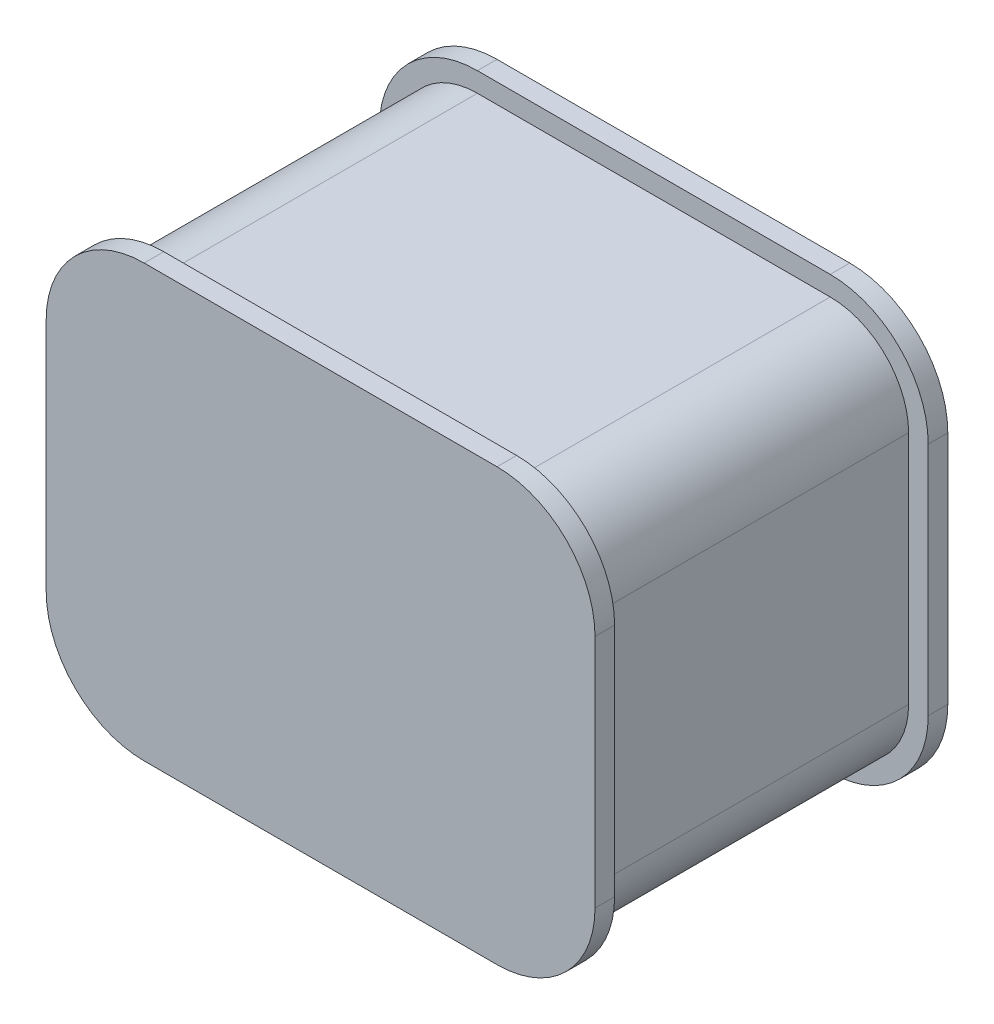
ISO-10303-21;
HEADER;
FILE_DESCRIPTION(('STEP AP214'),'2;1');
FILE_NAME('part.step','',(''),(''),'','','');
FILE_SCHEMA(('AUTOMOTIVE_DESIGN { 1 0 10303 214 1 1 1 1 }'));
ENDSEC;
DATA;
#1=APPLICATION_CONTEXT('core data for automotive mechanical design processes');
#2=APPLICATION_PROTOCOL_DEFINITION('international standard','automotive_design',2000,#1);
#3=PRODUCT_CONTEXT('',#1,'mechanical');
#4=PRODUCT('Part','Part','',(#3));
#5=PRODUCT_RELATED_PRODUCT_CATEGORY('part','',(#4));
#6=PRODUCT_DEFINITION_FORMATION('','',#4);
#7=PRODUCT_DEFINITION_CONTEXT('part definition',#1,'design');
#8=PRODUCT_DEFINITION('design','',#6,#7);
#9=PRODUCT_DEFINITION_SHAPE('','',#8);
#10=(LENGTH_UNIT() NAMED_UNIT(*) SI_UNIT(.MILLI.,.METRE.));
#11=(NAMED_UNIT(*) PLANE_ANGLE_UNIT() SI_UNIT($,.RADIAN.));
#12=(NAMED_UNIT(*) SI_UNIT($,.STERADIAN.) SOLID_ANGLE_UNIT());
#13=UNCERTAINTY_MEASURE_WITH_UNIT(LENGTH_MEASURE(1.E-05),#10,'distance_accuracy_value','');
#14=(GEOMETRIC_REPRESENTATION_CONTEXT(3) GLOBAL_UNCERTAINTY_ASSIGNED_CONTEXT((#13)) GLOBAL_UNIT_ASSIGNED_CONTEXT((#10,
#11,#12)) REPRESENTATION_CONTEXT('',''));
#15=CARTESIAN_POINT('',(0.,0.,0.));
#16=DIRECTION('',(0.,0.,1.));
#17=DIRECTION('',(1.,0.,0.));
#18=AXIS2_PLACEMENT_3D('',#15,#16,#17);
#19=CARTESIAN_POINT('',(-45.,30.,40.));
#20=DIRECTION('',(0.,0.,-1.));
#21=DIRECTION('',(-1.,0.,0.));
#22=AXIS2_PLACEMENT_3D('',#19,#20,#21);
#23=CYLINDRICAL_SURFACE('',#22,20.);
#24=DIRECTION('',(0.,0.,-1.));
#25=VECTOR('',#24,1.);
#26=CARTESIAN_POINT('',(-45.,50.,40.));
#27=LINE('',#26,#25);
#28=CARTESIAN_POINT('',(-45.,50.,40.));
#29=VERTEX_POINT('',#28);
#30=CARTESIAN_POINT('',(-45.,50.,-40.));
#31=VERTEX_POINT('',#30);
#32=EDGE_CURVE('E369',#29,#31,#27,.T.);
#33=ORIENTED_EDGE('',*,*,#32,.T.);
#34=CARTESIAN_POINT('',(-45.,30.,-40.));
#35=DIRECTION('',(0.,0.,1.));
#36=DIRECTION('',(1.,0.,0.));
#37=AXIS2_PLACEMENT_3D('',#34,#35,#36);
#38=CIRCLE('',#37,20.);
#39=CARTESIAN_POINT('',(-65.,30.,-40.));
#40=VERTEX_POINT('',#39);
#41=EDGE_CURVE('E200',#31,#40,#38,.T.);
#42=ORIENTED_EDGE('',*,*,#41,.T.);
#43=DIRECTION('',(0.,0.,-1.));
#44=VECTOR('',#43,1.);
#45=CARTESIAN_POINT('',(-65.,30.,40.));
#46=LINE('',#45,#44);
#47=CARTESIAN_POINT('',(-65.,30.,40.));
#48=VERTEX_POINT('',#47);
#49=EDGE_CURVE('E11',#48,#40,#46,.T.);
#50=ORIENTED_EDGE('',*,*,#49,.F.);
#51=CARTESIAN_POINT('',(-45.,30.,40.));
#52=DIRECTION('',(0.,0.,1.));
#53=DIRECTION('',(1.,0.,0.));
#54=AXIS2_PLACEMENT_3D('',#51,#52,#53);
#55=CIRCLE('',#54,20.);
#56=EDGE_CURVE('E345',#29,#48,#55,.T.);
#57=ORIENTED_EDGE('',*,*,#56,.F.);
#58=EDGE_LOOP('',(#33,#42,#50,#57));
#59=FACE_BOUND('',#58,.T.);
#60=ADVANCED_FACE('F29',(#59),#23,.T.);
#61=CARTESIAN_POINT('',(-65.,30.,40.));
#62=DIRECTION('',(1.,0.,0.));
#63=DIRECTION('',(0.,1.,0.));
#64=AXIS2_PLACEMENT_3D('',#61,#62,#63);
#65=PLANE('',#64);
#66=ORIENTED_EDGE('',*,*,#49,.T.);
#67=DIRECTION('',(0.,-1.,0.));
#68=VECTOR('',#67,1.);
#69=CARTESIAN_POINT('',(-65.,30.,-40.));
#70=LINE('',#69,#68);
#71=CARTESIAN_POINT('',(-65.,-30.,-40.));
#72=VERTEX_POINT('',#71);
#73=EDGE_CURVE('E268',#40,#72,#70,.T.);
#74=ORIENTED_EDGE('',*,*,#73,.T.);
#75=DIRECTION('',(0.,0.,-1.));
#76=VECTOR('',#75,1.);
#77=CARTESIAN_POINT('',(-65.,-30.,40.));
#78=LINE('',#77,#76);
#79=CARTESIAN_POINT('',(-65.,-30.,40.));
#80=VERTEX_POINT('',#79);
#81=EDGE_CURVE('E36',#80,#72,#78,.T.);
#82=ORIENTED_EDGE('',*,*,#81,.F.);
#83=DIRECTION('',(0.,-1.,0.));
#84=VECTOR('',#83,1.);
#85=CARTESIAN_POINT('',(-65.,30.,40.));
#86=LINE('',#85,#84);
#87=EDGE_CURVE('E348',#48,#80,#86,.T.);
#88=ORIENTED_EDGE('',*,*,#87,.F.);
#89=EDGE_LOOP('',(#66,#74,#82,#88));
#90=FACE_BOUND('',#89,.T.);
#91=ADVANCED_FACE('F388',(#90),#65,.F.);
#92=CARTESIAN_POINT('',(-45.,-30.,40.));
#93=DIRECTION('',(0.,0.,-1.));
#94=DIRECTION('',(-1.,0.,0.));
#95=AXIS2_PLACEMENT_3D('',#92,#93,#94);
#96=CYLINDRICAL_SURFACE('',#95,20.);
#97=ORIENTED_EDGE('',*,*,#81,.T.);
#98=CARTESIAN_POINT('',(-45.,-30.,-40.));
#99=DIRECTION('',(0.,0.,1.));
#100=DIRECTION('',(1.,0.,0.));
#101=AXIS2_PLACEMENT_3D('',#98,#99,#100);
#102=CIRCLE('',#101,20.);
#103=CARTESIAN_POINT('',(-45.,-50.,-40.));
#104=VERTEX_POINT('',#103);
#105=EDGE_CURVE('E271',#72,#104,#102,.T.);
#106=ORIENTED_EDGE('',*,*,#105,.T.);
#107=DIRECTION('',(0.,0.,-1.));
#108=VECTOR('',#107,1.);
#109=CARTESIAN_POINT('',(-45.,-50.,40.));
#110=LINE('',#109,#108);
#111=CARTESIAN_POINT('',(-45.,-50.,40.));
#112=VERTEX_POINT('',#111);
#113=EDGE_CURVE('E377',#112,#104,#110,.T.);
#114=ORIENTED_EDGE('',*,*,#113,.F.);
#115=CARTESIAN_POINT('',(-45.,-30.,40.));
#116=DIRECTION('',(0.,0.,1.));
#117=DIRECTION('',(1.,0.,0.));
#118=AXIS2_PLACEMENT_3D('',#115,#116,#117);
#119=CIRCLE('',#118,20.);
#120=EDGE_CURVE('E351',#80,#112,#119,.T.);
#121=ORIENTED_EDGE('',*,*,#120,.F.);
#122=EDGE_LOOP('',(#97,#106,#114,#121));
#123=FACE_BOUND('',#122,.T.);
#124=ADVANCED_FACE('F381',(#123),#96,.T.);
#125=CARTESIAN_POINT('',(-45.,-50.,40.));
#126=DIRECTION('',(0.,1.,0.));
#127=DIRECTION('',(-1.,0.,0.));
#128=AXIS2_PLACEMENT_3D('',#125,#126,#127);
#129=PLANE('',#128);
#130=ORIENTED_EDGE('',*,*,#113,.T.);
#131=DIRECTION('',(1.,0.,0.));
#132=VECTOR('',#131,1.);
#133=CARTESIAN_POINT('',(-45.,-50.,-40.));
#134=LINE('',#133,#132);
#135=CARTESIAN_POINT('',(45.,-50.,-40.));
#136=VERTEX_POINT('',#135);
#137=EDGE_CURVE('E274',#104,#136,#134,.T.);
#138=ORIENTED_EDGE('',*,*,#137,.T.);
#139=DIRECTION('',(0.,0.,-1.));
#140=VECTOR('',#139,1.);
#141=CARTESIAN_POINT('',(45.,-50.,40.));
#142=LINE('',#141,#140);
#143=CARTESIAN_POINT('',(45.,-50.,40.));
#144=VERTEX_POINT('',#143);
#145=EDGE_CURVE('E375',#144,#136,#142,.T.);
#146=ORIENTED_EDGE('',*,*,#145,.F.);
#147=DIRECTION('',(1.,0.,0.));
#148=VECTOR('',#147,1.);
#149=CARTESIAN_POINT('',(-45.,-50.,40.));
#150=LINE('',#149,#148);
#151=EDGE_CURVE('E354',#112,#144,#150,.T.);
#152=ORIENTED_EDGE('',*,*,#151,.F.);
#153=EDGE_LOOP('',(#130,#138,#146,#152));
#154=FACE_BOUND('',#153,.T.);
#155=ADVANCED_FACE('F405',(#154),#129,.F.);
#156=CARTESIAN_POINT('',(45.,-30.,40.));
#157=DIRECTION('',(0.,0.,-1.));
#158=DIRECTION('',(-1.,0.,0.));
#159=AXIS2_PLACEMENT_3D('',#156,#157,#158);
#160=CYLINDRICAL_SURFACE('',#159,20.);
#161=ORIENTED_EDGE('',*,*,#145,.T.);
#162=CARTESIAN_POINT('',(45.,-30.,-40.));
#163=DIRECTION('',(0.,0.,1.));
#164=DIRECTION('',(1.,0.,0.));
#165=AXIS2_PLACEMENT_3D('',#162,#163,#164);
#166=CIRCLE('',#165,20.);
#167=CARTESIAN_POINT('',(65.,-30.,-40.));
#168=VERTEX_POINT('',#167);
#169=EDGE_CURVE('E277',#136,#168,#166,.T.);
#170=ORIENTED_EDGE('',*,*,#169,.T.);
#171=DIRECTION('',(0.,0.,-1.));
#172=VECTOR('',#171,1.);
#173=CARTESIAN_POINT('',(65.,-30.,40.));
#174=LINE('',#173,#172);
#175=CARTESIAN_POINT('',(65.,-30.,40.));
#176=VERTEX_POINT('',#175);
#177=EDGE_CURVE('E373',#176,#168,#174,.T.);
#178=ORIENTED_EDGE('',*,*,#177,.F.);
#179=CARTESIAN_POINT('',(45.,-30.,40.));
#180=DIRECTION('',(0.,0.,1.));
#181=DIRECTION('',(1.,0.,0.));
#182=AXIS2_PLACEMENT_3D('',#179,#180,#181);
#183=CIRCLE('',#182,20.);
#184=EDGE_CURVE('E357',#144,#176,#183,.T.);
#185=ORIENTED_EDGE('',*,*,#184,.F.);
#186=EDGE_LOOP('',(#161,#170,#178,#185));
#187=FACE_BOUND('',#186,.T.);
#188=ADVANCED_FACE('F402',(#187),#160,.T.);
#189=CARTESIAN_POINT('',(65.,30.,40.));
#190=DIRECTION('',(-1.,0.,0.));
#191=DIRECTION('',(0.,0.,1.));
#192=AXIS2_PLACEMENT_3D('',#189,#190,#191);
#193=PLANE('',#192);
#194=ORIENTED_EDGE('',*,*,#177,.T.);
#195=DIRECTION('',(0.,1.,0.));
#196=VECTOR('',#195,1.);
#197=CARTESIAN_POINT('',(65.,30.,-40.));
#198=LINE('',#197,#196);
#199=CARTESIAN_POINT('',(65.,30.,-40.));
#200=VERTEX_POINT('',#199);
#201=EDGE_CURVE('E280',#168,#200,#198,.T.);
#202=ORIENTED_EDGE('',*,*,#201,.T.);
#203=DIRECTION('',(0.,0.,-1.));
#204=VECTOR('',#203,1.);
#205=CARTESIAN_POINT('',(65.,30.,40.));
#206=LINE('',#205,#204);
#207=CARTESIAN_POINT('',(65.,30.,40.));
#208=VERTEX_POINT('',#207);
#209=EDGE_CURVE('E51',#208,#200,#206,.T.);
#210=ORIENTED_EDGE('',*,*,#209,.F.);
#211=DIRECTION('',(0.,1.,0.));
#212=VECTOR('',#211,1.);
#213=CARTESIAN_POINT('',(65.,30.,40.));
#214=LINE('',#213,#212);
#215=EDGE_CURVE('E360',#176,#208,#214,.T.);
#216=ORIENTED_EDGE('',*,*,#215,.F.);
#217=EDGE_LOOP('',(#194,#202,#210,#216));
#218=FACE_BOUND('',#217,.T.);
#219=ADVANCED_FACE('F400',(#218),#193,.F.);
#220=CARTESIAN_POINT('',(45.,30.,40.));
#221=DIRECTION('',(0.,0.,-1.));
#222=DIRECTION('',(-1.,0.,0.));
#223=AXIS2_PLACEMENT_3D('',#220,#221,#222);
#224=CYLINDRICAL_SURFACE('',#223,20.);
#225=ORIENTED_EDGE('',*,*,#209,.T.);
#226=CARTESIAN_POINT('',(45.,30.,-40.));
#227=DIRECTION('',(0.,0.,1.));
#228=DIRECTION('',(-1.,0.,0.));
#229=AXIS2_PLACEMENT_3D('',#226,#227,#228);
#230=CIRCLE('',#229,20.);
#231=CARTESIAN_POINT('',(45.,50.,-40.));
#232=VERTEX_POINT('',#231);
#233=EDGE_CURVE('E282',#200,#232,#230,.T.);
#234=ORIENTED_EDGE('',*,*,#233,.T.);
#235=DIRECTION('',(0.,0.,-1.));
#236=VECTOR('',#235,1.);
#237=CARTESIAN_POINT('',(45.,50.,40.));
#238=LINE('',#237,#236);
#239=CARTESIAN_POINT('',(45.,50.,40.));
#240=VERTEX_POINT('',#239);
#241=EDGE_CURVE('E43',#240,#232,#238,.T.);
#242=ORIENTED_EDGE('',*,*,#241,.F.);
#243=CARTESIAN_POINT('',(45.,30.,40.));
#244=DIRECTION('',(0.,0.,1.));
#245=DIRECTION('',(-1.,0.,0.));
#246=AXIS2_PLACEMENT_3D('',#243,#244,#245);
#247=CIRCLE('',#246,20.);
#248=EDGE_CURVE('E363',#208,#240,#247,.T.);
#249=ORIENTED_EDGE('',*,*,#248,.F.);
#250=EDGE_LOOP('',(#225,#234,#242,#249));
#251=FACE_BOUND('',#250,.T.);
#252=ADVANCED_FACE('F398',(#251),#224,.T.);
#253=CARTESIAN_POINT('',(-45.,50.,40.));
#254=DIRECTION('',(0.,-1.,0.));
#255=DIRECTION('',(1.,0.,0.));
#256=AXIS2_PLACEMENT_3D('',#253,#254,#255);
#257=PLANE('',#256);
#258=ORIENTED_EDGE('',*,*,#241,.T.);
#259=DIRECTION('',(-1.,0.,0.));
#260=VECTOR('',#259,1.);
#261=CARTESIAN_POINT('',(-45.,50.,-40.));
#262=LINE('',#261,#260);
#263=EDGE_CURVE('E284',#232,#31,#262,.T.);
#264=ORIENTED_EDGE('',*,*,#263,.T.);
#265=ORIENTED_EDGE('',*,*,#32,.F.);
#266=DIRECTION('',(-1.,0.,0.));
#267=VECTOR('',#266,1.);
#268=CARTESIAN_POINT('',(-45.,50.,40.));
#269=LINE('',#268,#267);
#270=EDGE_CURVE('E366',#240,#29,#269,.T.);
#271=ORIENTED_EDGE('',*,*,#270,.F.);
#272=EDGE_LOOP('',(#258,#264,#265,#271));
#273=FACE_BOUND('',#272,.T.);
#274=ADVANCED_FACE('F395',(#273),#257,.F.);
#275=CARTESIAN_POINT('',(-45.,30.,40.));
#276=DIRECTION('',(0.,0.,1.));
#277=DIRECTION('',(1.,0.,0.));
#278=AXIS2_PLACEMENT_3D('',#275,#276,#277);
#279=PLANE('',#278);
#280=CARTESIAN_POINT('',(-45.,30.,40.));
#281=DIRECTION('',(0.,0.,1.));
#282=DIRECTION('',(1.,0.,0.));
#283=AXIS2_PLACEMENT_3D('',#280,#281,#282);
#284=CIRCLE('',#283,25.);
#285=CARTESIAN_POINT('',(-45.,55.,40.));
#286=VERTEX_POINT('',#285);
#287=CARTESIAN_POINT('',(-70.,30.,40.));
#288=VERTEX_POINT('',#287);
#289=EDGE_CURVE('E287',#286,#288,#284,.T.);
#290=ORIENTED_EDGE('',*,*,#289,.F.);
#291=DIRECTION('',(-1.,0.,0.));
#292=VECTOR('',#291,1.);
#293=CARTESIAN_POINT('',(45.,55.,40.));
#294=LINE('',#293,#292);
#295=CARTESIAN_POINT('',(45.,55.,40.));
#296=VERTEX_POINT('',#295);
#297=EDGE_CURVE('E302',#296,#286,#294,.T.);
#298=ORIENTED_EDGE('',*,*,#297,.F.);
#299=CARTESIAN_POINT('',(45.,30.,40.));
#300=DIRECTION('',(0.,0.,1.));
#301=DIRECTION('',(1.,0.,0.));
#302=AXIS2_PLACEMENT_3D('',#299,#300,#301);
#303=CIRCLE('',#302,25.);
#304=CARTESIAN_POINT('',(70.,30.,40.));
#305=VERTEX_POINT('',#304);
#306=EDGE_CURVE('E300',#305,#296,#303,.T.);
#307=ORIENTED_EDGE('',*,*,#306,.F.);
#308=DIRECTION('',(0.,1.,0.));
#309=VECTOR('',#308,1.);
#310=CARTESIAN_POINT('',(70.,-30.,40.));
#311=LINE('',#310,#309);
#312=CARTESIAN_POINT('',(70.,-30.,40.));
#313=VERTEX_POINT('',#312);
#314=EDGE_CURVE('E298',#313,#305,#311,.T.);
#315=ORIENTED_EDGE('',*,*,#314,.F.);
#316=CARTESIAN_POINT('',(45.,-30.,40.));
#317=DIRECTION('',(0.,0.,1.));
#318=DIRECTION('',(1.,0.,0.));
#319=AXIS2_PLACEMENT_3D('',#316,#317,#318);
#320=CIRCLE('',#319,25.);
#321=CARTESIAN_POINT('',(45.,-55.,40.));
#322=VERTEX_POINT('',#321);
#323=EDGE_CURVE('E296',#322,#313,#320,.T.);
#324=ORIENTED_EDGE('',*,*,#323,.F.);
#325=DIRECTION('',(1.,0.,0.));
#326=VECTOR('',#325,1.);
#327=CARTESIAN_POINT('',(-45.,-55.,40.));
#328=LINE('',#327,#326);
#329=CARTESIAN_POINT('',(-45.,-55.,40.));
#330=VERTEX_POINT('',#329);
#331=EDGE_CURVE('E294',#330,#322,#328,.T.);
#332=ORIENTED_EDGE('',*,*,#331,.F.);
#333=CARTESIAN_POINT('',(-45.,-30.,40.));
#334=DIRECTION('',(0.,0.,1.));
#335=DIRECTION('',(1.,0.,0.));
#336=AXIS2_PLACEMENT_3D('',#333,#334,#335);
#337=CIRCLE('',#336,25.);
#338=CARTESIAN_POINT('',(-70.,-30.,40.));
#339=VERTEX_POINT('',#338);
#340=EDGE_CURVE('E292',#339,#330,#337,.T.);
#341=ORIENTED_EDGE('',*,*,#340,.F.);
#342=DIRECTION('',(0.,-1.,0.));
#343=VECTOR('',#342,1.);
#344=CARTESIAN_POINT('',(-70.,30.,40.));
#345=LINE('',#344,#343);
#346=EDGE_CURVE('E290',#288,#339,#345,.T.);
#347=ORIENTED_EDGE('',*,*,#346,.F.);
#348=EDGE_LOOP('',(#290,#298,#307,#315,#324,#332,#341,#347));
#349=FACE_BOUND('',#348,.T.);
#350=ORIENTED_EDGE('',*,*,#270,.T.);
#351=ORIENTED_EDGE('',*,*,#56,.T.);
#352=ORIENTED_EDGE('',*,*,#87,.T.);
#353=ORIENTED_EDGE('',*,*,#120,.T.);
#354=ORIENTED_EDGE('',*,*,#151,.T.);
#355=ORIENTED_EDGE('',*,*,#184,.T.);
#356=ORIENTED_EDGE('',*,*,#215,.T.);
#357=ORIENTED_EDGE('',*,*,#248,.T.);
#358=EDGE_LOOP('',(#350,#351,#352,#353,#354,#355,#356,#357));
#359=FACE_BOUND('',#358,.T.);
#360=ADVANCED_FACE('F393',(#349,#359),#279,.F.);
#361=CARTESIAN_POINT('',(-45.,30.,45.));
#362=DIRECTION('',(0.,0.,-1.));
#363=DIRECTION('',(-1.,0.,0.));
#364=AXIS2_PLACEMENT_3D('',#361,#362,#363);
#365=CYLINDRICAL_SURFACE('',#364,25.);
#366=ORIENTED_EDGE('',*,*,#289,.T.);
#367=DIRECTION('',(0.,0.,-1.));
#368=VECTOR('',#367,1.);
#369=CARTESIAN_POINT('',(-70.,30.,45.));
#370=LINE('',#369,#368);
#371=CARTESIAN_POINT('',(-70.,30.,45.));
#372=VERTEX_POINT('',#371);
#373=EDGE_CURVE('E342',#372,#288,#370,.T.);
#374=ORIENTED_EDGE('',*,*,#373,.F.);
#375=CARTESIAN_POINT('',(-45.,30.,45.));
#376=DIRECTION('',(0.,0.,1.));
#377=DIRECTION('',(1.,0.,0.));
#378=AXIS2_PLACEMENT_3D('',#375,#376,#377);
#379=CIRCLE('',#378,25.);
#380=CARTESIAN_POINT('',(-45.,55.,45.));
#381=VERTEX_POINT('',#380);
#382=EDGE_CURVE('E304',#381,#372,#379,.T.);
#383=ORIENTED_EDGE('',*,*,#382,.F.);
#384=DIRECTION('',(0.,0.,-1.));
#385=VECTOR('',#384,1.);
#386=CARTESIAN_POINT('',(-45.,55.,45.));
#387=LINE('',#386,#385);
#388=EDGE_CURVE('E321',#381,#286,#387,.T.);
#389=ORIENTED_EDGE('',*,*,#388,.T.);
#390=EDGE_LOOP('',(#366,#374,#383,#389));
#391=FACE_BOUND('',#390,.T.);
#392=ADVANCED_FACE('F549',(#391),#365,.T.);
#393=CARTESIAN_POINT('',(-70.,30.,45.));
#394=DIRECTION('',(1.,0.,0.));
#395=DIRECTION('',(0.,1.,0.));
#396=AXIS2_PLACEMENT_3D('',#393,#394,#395);
#397=PLANE('',#396);
#398=ORIENTED_EDGE('',*,*,#346,.T.);
#399=DIRECTION('',(0.,0.,-1.));
#400=VECTOR('',#399,1.);
#401=CARTESIAN_POINT('',(-70.,-30.,45.));
#402=LINE('',#401,#400);
#403=CARTESIAN_POINT('',(-70.,-30.,45.));
#404=VERTEX_POINT('',#403);
#405=EDGE_CURVE('E339',#404,#339,#402,.T.);
#406=ORIENTED_EDGE('',*,*,#405,.F.);
#407=DIRECTION('',(0.,-1.,0.));
#408=VECTOR('',#407,1.);
#409=CARTESIAN_POINT('',(-70.,30.,45.));
#410=LINE('',#409,#408);
#411=EDGE_CURVE('E307',#372,#404,#410,.T.);
#412=ORIENTED_EDGE('',*,*,#411,.F.);
#413=ORIENTED_EDGE('',*,*,#373,.T.);
#414=EDGE_LOOP('',(#398,#406,#412,#413));
#415=FACE_BOUND('',#414,.T.);
#416=ADVANCED_FACE('F577',(#415),#397,.F.);
#417=CARTESIAN_POINT('',(-45.,-30.,45.));
#418=DIRECTION('',(0.,0.,-1.));
#419=DIRECTION('',(-1.,0.,0.));
#420=AXIS2_PLACEMENT_3D('',#417,#418,#419);
#421=CYLINDRICAL_SURFACE('',#420,25.);
#422=ORIENTED_EDGE('',*,*,#340,.T.);
#423=DIRECTION('',(0.,0.,-1.));
#424=VECTOR('',#423,1.);
#425=CARTESIAN_POINT('',(-45.,-55.,45.));
#426=LINE('',#425,#424);
#427=CARTESIAN_POINT('',(-45.,-55.,45.));
#428=VERTEX_POINT('',#427);
#429=EDGE_CURVE('E336',#428,#330,#426,.T.);
#430=ORIENTED_EDGE('',*,*,#429,.F.);
#431=CARTESIAN_POINT('',(-45.,-30.,45.));
#432=DIRECTION('',(0.,0.,1.));
#433=DIRECTION('',(1.,0.,0.));
#434=AXIS2_PLACEMENT_3D('',#431,#432,#433);
#435=CIRCLE('',#434,25.);
#436=EDGE_CURVE('E309',#404,#428,#435,.T.);
#437=ORIENTED_EDGE('',*,*,#436,.F.);
#438=ORIENTED_EDGE('',*,*,#405,.T.);
#439=EDGE_LOOP('',(#422,#430,#437,#438));
#440=FACE_BOUND('',#439,.T.);
#441=ADVANCED_FACE('F573',(#440),#421,.T.);
#442=CARTESIAN_POINT('',(-45.,-55.,45.));
#443=DIRECTION('',(0.,1.,0.));
#444=DIRECTION('',(-1.,0.,0.));
#445=AXIS2_PLACEMENT_3D('',#442,#443,#444);
#446=PLANE('',#445);
#447=ORIENTED_EDGE('',*,*,#331,.T.);
#448=DIRECTION('',(0.,0.,-1.));
#449=VECTOR('',#448,1.);
#450=CARTESIAN_POINT('',(45.,-55.,45.));
#451=LINE('',#450,#449);
#452=CARTESIAN_POINT('',(45.,-55.,45.));
#453=VERTEX_POINT('',#452);
#454=EDGE_CURVE('E333',#453,#322,#451,.T.);
#455=ORIENTED_EDGE('',*,*,#454,.F.);
#456=DIRECTION('',(1.,0.,0.));
#457=VECTOR('',#456,1.);
#458=CARTESIAN_POINT('',(-45.,-55.,45.));
#459=LINE('',#458,#457);
#460=EDGE_CURVE('E311',#428,#453,#459,.T.);
#461=ORIENTED_EDGE('',*,*,#460,.F.);
#462=ORIENTED_EDGE('',*,*,#429,.T.);
#463=EDGE_LOOP('',(#447,#455,#461,#462));
#464=FACE_BOUND('',#463,.T.);
#465=ADVANCED_FACE('F569',(#464),#446,.F.);
#466=CARTESIAN_POINT('',(45.,-30.,45.));
#467=DIRECTION('',(0.,0.,-1.));
#468=DIRECTION('',(-1.,0.,0.));
#469=AXIS2_PLACEMENT_3D('',#466,#467,#468);
#470=CYLINDRICAL_SURFACE('',#469,25.);
#471=ORIENTED_EDGE('',*,*,#323,.T.);
#472=DIRECTION('',(0.,0.,-1.));
#473=VECTOR('',#472,1.);
#474=CARTESIAN_POINT('',(70.,-30.,45.));
#475=LINE('',#474,#473);
#476=CARTESIAN_POINT('',(70.,-30.,45.));
#477=VERTEX_POINT('',#476);
#478=EDGE_CURVE('E330',#477,#313,#475,.T.);
#479=ORIENTED_EDGE('',*,*,#478,.F.);
#480=CARTESIAN_POINT('',(45.,-30.,45.));
#481=DIRECTION('',(0.,0.,1.));
#482=DIRECTION('',(1.,0.,0.));
#483=AXIS2_PLACEMENT_3D('',#480,#481,#482);
#484=CIRCLE('',#483,25.);
#485=EDGE_CURVE('E313',#453,#477,#484,.T.);
#486=ORIENTED_EDGE('',*,*,#485,.F.);
#487=ORIENTED_EDGE('',*,*,#454,.T.);
#488=EDGE_LOOP('',(#471,#479,#486,#487));
#489=FACE_BOUND('',#488,.T.);
#490=ADVANCED_FACE('F565',(#489),#470,.T.);
#491=CARTESIAN_POINT('',(70.,-30.,45.));
#492=DIRECTION('',(-1.,0.,0.));
#493=DIRECTION('',(0.,-1.,0.));
#494=AXIS2_PLACEMENT_3D('',#491,#492,#493);
#495=PLANE('',#494);
#496=ORIENTED_EDGE('',*,*,#314,.T.);
#497=DIRECTION('',(0.,0.,-1.));
#498=VECTOR('',#497,1.);
#499=CARTESIAN_POINT('',(70.,30.,45.));
#500=LINE('',#499,#498);
#501=CARTESIAN_POINT('',(70.,30.,45.));
#502=VERTEX_POINT('',#501);
#503=EDGE_CURVE('E327',#502,#305,#500,.T.);
#504=ORIENTED_EDGE('',*,*,#503,.F.);
#505=DIRECTION('',(0.,1.,0.));
#506=VECTOR('',#505,1.);
#507=CARTESIAN_POINT('',(70.,-30.,45.));
#508=LINE('',#507,#506);
#509=EDGE_CURVE('E315',#477,#502,#508,.T.);
#510=ORIENTED_EDGE('',*,*,#509,.F.);
#511=ORIENTED_EDGE('',*,*,#478,.T.);
#512=EDGE_LOOP('',(#496,#504,#510,#511));
#513=FACE_BOUND('',#512,.T.);
#514=ADVANCED_FACE('F561',(#513),#495,.F.);
#515=CARTESIAN_POINT('',(45.,30.,45.));
#516=DIRECTION('',(0.,0.,-1.));
#517=DIRECTION('',(-1.,0.,0.));
#518=AXIS2_PLACEMENT_3D('',#515,#516,#517);
#519=CYLINDRICAL_SURFACE('',#518,25.);
#520=ORIENTED_EDGE('',*,*,#306,.T.);
#521=DIRECTION('',(0.,0.,-1.));
#522=VECTOR('',#521,1.);
#523=CARTESIAN_POINT('',(45.,55.,45.));
#524=LINE('',#523,#522);
#525=CARTESIAN_POINT('',(45.,55.,45.));
#526=VERTEX_POINT('',#525);
#527=EDGE_CURVE('E324',#526,#296,#524,.T.);
#528=ORIENTED_EDGE('',*,*,#527,.F.);
#529=CARTESIAN_POINT('',(45.,30.,45.));
#530=DIRECTION('',(0.,0.,1.));
#531=DIRECTION('',(1.,0.,0.));
#532=AXIS2_PLACEMENT_3D('',#529,#530,#531);
#533=CIRCLE('',#532,25.);
#534=EDGE_CURVE('E317',#502,#526,#533,.T.);
#535=ORIENTED_EDGE('',*,*,#534,.F.);
#536=ORIENTED_EDGE('',*,*,#503,.T.);
#537=EDGE_LOOP('',(#520,#528,#535,#536));
#538=FACE_BOUND('',#537,.T.);
#539=ADVANCED_FACE('F557',(#538),#519,.T.);
#540=CARTESIAN_POINT('',(45.,55.,45.));
#541=DIRECTION('',(0.,-1.,0.));
#542=DIRECTION('',(1.,0.,0.));
#543=AXIS2_PLACEMENT_3D('',#540,#541,#542);
#544=PLANE('',#543);
#545=ORIENTED_EDGE('',*,*,#297,.T.);
#546=ORIENTED_EDGE('',*,*,#388,.F.);
#547=DIRECTION('',(-1.,0.,0.));
#548=VECTOR('',#547,1.);
#549=CARTESIAN_POINT('',(45.,55.,45.));
#550=LINE('',#549,#548);
#551=EDGE_CURVE('E319',#526,#381,#550,.T.);
#552=ORIENTED_EDGE('',*,*,#551,.F.);
#553=ORIENTED_EDGE('',*,*,#527,.T.);
#554=EDGE_LOOP('',(#545,#546,#552,#553));
#555=FACE_BOUND('',#554,.T.);
#556=ADVANCED_FACE('F553',(#555),#544,.F.);
#557=CARTESIAN_POINT('',(-45.,30.,45.));
#558=DIRECTION('',(0.,0.,1.));
#559=DIRECTION('',(1.,0.,0.));
#560=AXIS2_PLACEMENT_3D('',#557,#558,#559);
#561=PLANE('',#560);
#562=ORIENTED_EDGE('',*,*,#382,.T.);
#563=ORIENTED_EDGE('',*,*,#411,.T.);
#564=ORIENTED_EDGE('',*,*,#436,.T.);
#565=ORIENTED_EDGE('',*,*,#460,.T.);
#566=ORIENTED_EDGE('',*,*,#485,.T.);
#567=ORIENTED_EDGE('',*,*,#509,.T.);
#568=ORIENTED_EDGE('',*,*,#534,.T.);
#569=ORIENTED_EDGE('',*,*,#551,.T.);
#570=EDGE_LOOP('',(#562,#563,#564,#565,#566,#567,#568,#569));
#571=FACE_BOUND('',#570,.T.);
#572=ADVANCED_FACE('F477',(#571),#561,.T.);
#573=CARTESIAN_POINT('',(-45.,30.,-40.));
#574=DIRECTION('',(0.,0.,-1.));
#575=DIRECTION('',(1.,0.,0.));
#576=AXIS2_PLACEMENT_3D('',#573,#574,#575);
#577=PLANE('',#576);
#578=CARTESIAN_POINT('',(-45.,30.,-40.));
#579=DIRECTION('',(0.,0.,1.));
#580=DIRECTION('',(1.,0.,0.));
#581=AXIS2_PLACEMENT_3D('',#578,#579,#580);
#582=CIRCLE('',#581,25.);
#583=CARTESIAN_POINT('',(-45.,55.,-40.));
#584=VERTEX_POINT('',#583);
#585=CARTESIAN_POINT('',(-70.,30.,-40.));
#586=VERTEX_POINT('',#585);
#587=EDGE_CURVE('E195',#584,#586,#582,.T.);
#588=ORIENTED_EDGE('',*,*,#587,.T.);
#589=DIRECTION('',(0.,-1.,0.));
#590=VECTOR('',#589,1.);
#591=CARTESIAN_POINT('',(-70.,30.,-40.));
#592=LINE('',#591,#590);
#593=CARTESIAN_POINT('',(-70.,-30.,-40.));
#594=VERTEX_POINT('',#593);
#595=EDGE_CURVE('E204',#586,#594,#592,.T.);
#596=ORIENTED_EDGE('',*,*,#595,.T.);
#597=CARTESIAN_POINT('',(-45.,-30.,-40.));
#598=DIRECTION('',(0.,0.,1.));
#599=DIRECTION('',(1.,0.,0.));
#600=AXIS2_PLACEMENT_3D('',#597,#598,#599);
#601=CIRCLE('',#600,25.);
#602=CARTESIAN_POINT('',(-45.,-55.,-40.));
#603=VERTEX_POINT('',#602);
#604=EDGE_CURVE('E210',#594,#603,#601,.T.);
#605=ORIENTED_EDGE('',*,*,#604,.T.);
#606=DIRECTION('',(1.,0.,0.));
#607=VECTOR('',#606,1.);
#608=CARTESIAN_POINT('',(-45.,-55.,-40.));
#609=LINE('',#608,#607);
#610=CARTESIAN_POINT('',(45.,-55.,-40.));
#611=VERTEX_POINT('',#610);
#612=EDGE_CURVE('E221',#603,#611,#609,.T.);
#613=ORIENTED_EDGE('',*,*,#612,.T.);
#614=CARTESIAN_POINT('',(45.,-30.,-40.));
#615=DIRECTION('',(0.,0.,1.));
#616=DIRECTION('',(1.,0.,0.));
#617=AXIS2_PLACEMENT_3D('',#614,#615,#616);
#618=CIRCLE('',#617,25.);
#619=CARTESIAN_POINT('',(70.,-30.,-40.));
#620=VERTEX_POINT('',#619);
#621=EDGE_CURVE('E224',#611,#620,#618,.T.);
#622=ORIENTED_EDGE('',*,*,#621,.T.);
#623=DIRECTION('',(0.,1.,0.));
#624=VECTOR('',#623,1.);
#625=CARTESIAN_POINT('',(70.,-30.,-40.));
#626=LINE('',#625,#624);
#627=CARTESIAN_POINT('',(70.,30.,-40.));
#628=VERTEX_POINT('',#627);
#629=EDGE_CURVE('E227',#620,#628,#626,.T.);
#630=ORIENTED_EDGE('',*,*,#629,.T.);
#631=CARTESIAN_POINT('',(45.,30.,-40.));
#632=DIRECTION('',(0.,0.,1.));
#633=DIRECTION('',(1.,0.,0.));
#634=AXIS2_PLACEMENT_3D('',#631,#632,#633);
#635=CIRCLE('',#634,25.);
#636=CARTESIAN_POINT('',(45.,55.,-40.));
#637=VERTEX_POINT('',#636);
#638=EDGE_CURVE('E230',#628,#637,#635,.T.);
#639=ORIENTED_EDGE('',*,*,#638,.T.);
#640=DIRECTION('',(-1.,0.,0.));
#641=VECTOR('',#640,1.);
#642=CARTESIAN_POINT('',(45.,55.,-40.));
#643=LINE('',#642,#641);
#644=EDGE_CURVE('E217',#637,#584,#643,.T.);
#645=ORIENTED_EDGE('',*,*,#644,.T.);
#646=EDGE_LOOP('',(#588,#596,#605,#613,#622,#630,#639,#645));
#647=FACE_BOUND('',#646,.T.);
#648=ORIENTED_EDGE('',*,*,#263,.F.);
#649=ORIENTED_EDGE('',*,*,#233,.F.);
#650=ORIENTED_EDGE('',*,*,#201,.F.);
#651=ORIENTED_EDGE('',*,*,#169,.F.);
#652=ORIENTED_EDGE('',*,*,#137,.F.);
#653=ORIENTED_EDGE('',*,*,#105,.F.);
#654=ORIENTED_EDGE('',*,*,#73,.F.);
#655=ORIENTED_EDGE('',*,*,#41,.F.);
#656=EDGE_LOOP('',(#648,#649,#650,#651,#652,#653,#654,#655));
#657=FACE_BOUND('',#656,.T.);
#658=ADVANCED_FACE('F213',(#647,#657),#577,.F.);
#659=CARTESIAN_POINT('',(-45.,30.,-45.));
#660=DIRECTION('',(0.,0.,1.));
#661=DIRECTION('',(-1.,0.,0.));
#662=AXIS2_PLACEMENT_3D('',#659,#660,#661);
#663=CYLINDRICAL_SURFACE('',#662,25.);
#664=ORIENTED_EDGE('',*,*,#587,.F.);
#665=DIRECTION('',(0.,0.,1.));
#666=VECTOR('',#665,1.);
#667=CARTESIAN_POINT('',(-45.,55.,-45.));
#668=LINE('',#667,#666);
#669=CARTESIAN_POINT('',(-45.,55.,-45.));
#670=VERTEX_POINT('',#669);
#671=EDGE_CURVE('E253',#670,#584,#668,.T.);
#672=ORIENTED_EDGE('',*,*,#671,.F.);
#673=CARTESIAN_POINT('',(-45.,30.,-45.));
#674=DIRECTION('',(0.,0.,1.));
#675=DIRECTION('',(1.,0.,0.));
#676=AXIS2_PLACEMENT_3D('',#673,#674,#675);
#677=CIRCLE('',#676,25.);
#678=CARTESIAN_POINT('',(-70.,30.,-45.));
#679=VERTEX_POINT('',#678);
#680=EDGE_CURVE('E197',#670,#679,#677,.T.);
#681=ORIENTED_EDGE('',*,*,#680,.T.);
#682=DIRECTION('',(0.,0.,1.));
#683=VECTOR('',#682,1.);
#684=CARTESIAN_POINT('',(-70.,30.,-45.));
#685=LINE('',#684,#683);
#686=EDGE_CURVE('E190',#679,#586,#685,.T.);
#687=ORIENTED_EDGE('',*,*,#686,.T.);
#688=EDGE_LOOP('',(#664,#672,#681,#687));
#689=FACE_BOUND('',#688,.T.);
#690=ADVANCED_FACE('F192',(#689),#663,.T.);
#691=CARTESIAN_POINT('',(-70.,30.,-45.));
#692=DIRECTION('',(1.,0.,0.));
#693=DIRECTION('',(0.,1.,0.));
#694=AXIS2_PLACEMENT_3D('',#691,#692,#693);
#695=PLANE('',#694);
#696=ORIENTED_EDGE('',*,*,#595,.F.);
#697=ORIENTED_EDGE('',*,*,#686,.F.);
#698=DIRECTION('',(0.,-1.,0.));
#699=VECTOR('',#698,1.);
#700=CARTESIAN_POINT('',(-70.,30.,-45.));
#701=LINE('',#700,#699);
#702=CARTESIAN_POINT('',(-70.,-30.,-45.));
#703=VERTEX_POINT('',#702);
#704=EDGE_CURVE('E234',#679,#703,#701,.T.);
#705=ORIENTED_EDGE('',*,*,#704,.T.);
#706=DIRECTION('',(0.,0.,1.));
#707=VECTOR('',#706,1.);
#708=CARTESIAN_POINT('',(-70.,-30.,-45.));
#709=LINE('',#708,#707);
#710=EDGE_CURVE('E201',#703,#594,#709,.T.);
#711=ORIENTED_EDGE('',*,*,#710,.T.);
#712=EDGE_LOOP('',(#696,#697,#705,#711));
#713=FACE_BOUND('',#712,.T.);
#714=ADVANCED_FACE('F205',(#713),#695,.F.);
#715=CARTESIAN_POINT('',(-45.,-30.,-45.));
#716=DIRECTION('',(0.,0.,1.));
#717=DIRECTION('',(-1.,0.,0.));
#718=AXIS2_PLACEMENT_3D('',#715,#716,#717);
#719=CYLINDRICAL_SURFACE('',#718,25.);
#720=ORIENTED_EDGE('',*,*,#604,.F.);
#721=ORIENTED_EDGE('',*,*,#710,.F.);
#722=CARTESIAN_POINT('',(-45.,-30.,-45.));
#723=DIRECTION('',(0.,0.,1.));
#724=DIRECTION('',(1.,0.,0.));
#725=AXIS2_PLACEMENT_3D('',#722,#723,#724);
#726=CIRCLE('',#725,25.);
#727=CARTESIAN_POINT('',(-45.,-55.,-45.));
#728=VERTEX_POINT('',#727);
#729=EDGE_CURVE('E236',#703,#728,#726,.T.);
#730=ORIENTED_EDGE('',*,*,#729,.T.);
#731=DIRECTION('',(0.,0.,1.));
#732=VECTOR('',#731,1.);
#733=CARTESIAN_POINT('',(-45.,-55.,-45.));
#734=LINE('',#733,#732);
#735=EDGE_CURVE('E263',#728,#603,#734,.T.);
#736=ORIENTED_EDGE('',*,*,#735,.T.);
#737=EDGE_LOOP('',(#720,#721,#730,#736));
#738=FACE_BOUND('',#737,.T.);
#739=ADVANCED_FACE('F490',(#738),#719,.T.);
#740=CARTESIAN_POINT('',(-45.,-55.,-45.));
#741=DIRECTION('',(0.,1.,0.));
#742=DIRECTION('',(-1.,0.,0.));
#743=AXIS2_PLACEMENT_3D('',#740,#741,#742);
#744=PLANE('',#743);
#745=ORIENTED_EDGE('',*,*,#612,.F.);
#746=ORIENTED_EDGE('',*,*,#735,.F.);
#747=DIRECTION('',(1.,0.,0.));
#748=VECTOR('',#747,1.);
#749=CARTESIAN_POINT('',(-45.,-55.,-45.));
#750=LINE('',#749,#748);
#751=CARTESIAN_POINT('',(45.,-55.,-45.));
#752=VERTEX_POINT('',#751);
#753=EDGE_CURVE('E239',#728,#752,#750,.T.);
#754=ORIENTED_EDGE('',*,*,#753,.T.);
#755=DIRECTION('',(0.,0.,1.));
#756=VECTOR('',#755,1.);
#757=CARTESIAN_POINT('',(45.,-55.,-45.));
#758=LINE('',#757,#756);
#759=EDGE_CURVE('E261',#752,#611,#758,.T.);
#760=ORIENTED_EDGE('',*,*,#759,.T.);
#761=EDGE_LOOP('',(#745,#746,#754,#760));
#762=FACE_BOUND('',#761,.T.);
#763=ADVANCED_FACE('F497',(#762),#744,.F.);
#764=CARTESIAN_POINT('',(45.,-30.,-45.));
#765=DIRECTION('',(0.,0.,1.));
#766=DIRECTION('',(-1.,0.,0.));
#767=AXIS2_PLACEMENT_3D('',#764,#765,#766);
#768=CYLINDRICAL_SURFACE('',#767,25.);
#769=ORIENTED_EDGE('',*,*,#621,.F.);
#770=ORIENTED_EDGE('',*,*,#759,.F.);
#771=CARTESIAN_POINT('',(45.,-30.,-45.));
#772=DIRECTION('',(0.,0.,1.));
#773=DIRECTION('',(1.,0.,0.));
#774=AXIS2_PLACEMENT_3D('',#771,#772,#773);
#775=CIRCLE('',#774,25.);
#776=CARTESIAN_POINT('',(70.,-30.,-45.));
#777=VERTEX_POINT('',#776);
#778=EDGE_CURVE('E242',#752,#777,#775,.T.);
#779=ORIENTED_EDGE('',*,*,#778,.T.);
#780=DIRECTION('',(0.,0.,1.));
#781=VECTOR('',#780,1.);
#782=CARTESIAN_POINT('',(70.,-30.,-45.));
#783=LINE('',#782,#781);
#784=EDGE_CURVE('E259',#777,#620,#783,.T.);
#785=ORIENTED_EDGE('',*,*,#784,.T.);
#786=EDGE_LOOP('',(#769,#770,#779,#785));
#787=FACE_BOUND('',#786,.T.);
#788=ADVANCED_FACE('F505',(#787),#768,.T.);
#789=CARTESIAN_POINT('',(70.,-30.,-45.));
#790=DIRECTION('',(-1.,0.,0.));
#791=DIRECTION('',(0.,-1.,0.));
#792=AXIS2_PLACEMENT_3D('',#789,#790,#791);
#793=PLANE('',#792);
#794=ORIENTED_EDGE('',*,*,#629,.F.);
#795=ORIENTED_EDGE('',*,*,#784,.F.);
#796=DIRECTION('',(0.,1.,0.));
#797=VECTOR('',#796,1.);
#798=CARTESIAN_POINT('',(70.,-30.,-45.));
#799=LINE('',#798,#797);
#800=CARTESIAN_POINT('',(70.,30.,-45.));
#801=VERTEX_POINT('',#800);
#802=EDGE_CURVE('E245',#777,#801,#799,.T.);
#803=ORIENTED_EDGE('',*,*,#802,.T.);
#804=DIRECTION('',(0.,0.,1.));
#805=VECTOR('',#804,1.);
#806=CARTESIAN_POINT('',(70.,30.,-45.));
#807=LINE('',#806,#805);
#808=EDGE_CURVE('E257',#801,#628,#807,.T.);
#809=ORIENTED_EDGE('',*,*,#808,.T.);
#810=EDGE_LOOP('',(#794,#795,#803,#809));
#811=FACE_BOUND('',#810,.T.);
#812=ADVANCED_FACE('F513',(#811),#793,.F.);
#813=CARTESIAN_POINT('',(45.,30.,-45.));
#814=DIRECTION('',(0.,0.,1.));
#815=DIRECTION('',(-1.,0.,0.));
#816=AXIS2_PLACEMENT_3D('',#813,#814,#815);
#817=CYLINDRICAL_SURFACE('',#816,25.);
#818=ORIENTED_EDGE('',*,*,#638,.F.);
#819=ORIENTED_EDGE('',*,*,#808,.F.);
#820=CARTESIAN_POINT('',(45.,30.,-45.));
#821=DIRECTION('',(0.,0.,1.));
#822=DIRECTION('',(1.,0.,0.));
#823=AXIS2_PLACEMENT_3D('',#820,#821,#822);
#824=CIRCLE('',#823,25.);
#825=CARTESIAN_POINT('',(45.,55.,-45.));
#826=VERTEX_POINT('',#825);
#827=EDGE_CURVE('E248',#801,#826,#824,.T.);
#828=ORIENTED_EDGE('',*,*,#827,.T.);
#829=DIRECTION('',(0.,0.,1.));
#830=VECTOR('',#829,1.);
#831=CARTESIAN_POINT('',(45.,55.,-45.));
#832=LINE('',#831,#830);
#833=EDGE_CURVE('E255',#826,#637,#832,.T.);
#834=ORIENTED_EDGE('',*,*,#833,.T.);
#835=EDGE_LOOP('',(#818,#819,#828,#834));
#836=FACE_BOUND('',#835,.T.);
#837=ADVANCED_FACE('F521',(#836),#817,.T.);
#838=CARTESIAN_POINT('',(45.,55.,-45.));
#839=DIRECTION('',(0.,-1.,0.));
#840=DIRECTION('',(1.,0.,0.));
#841=AXIS2_PLACEMENT_3D('',#838,#839,#840);
#842=PLANE('',#841);
#843=ORIENTED_EDGE('',*,*,#644,.F.);
#844=ORIENTED_EDGE('',*,*,#833,.F.);
#845=DIRECTION('',(-1.,0.,0.));
#846=VECTOR('',#845,1.);
#847=CARTESIAN_POINT('',(45.,55.,-45.));
#848=LINE('',#847,#846);
#849=EDGE_CURVE('E251',#826,#670,#848,.T.);
#850=ORIENTED_EDGE('',*,*,#849,.T.);
#851=ORIENTED_EDGE('',*,*,#671,.T.);
#852=EDGE_LOOP('',(#843,#844,#850,#851));
#853=FACE_BOUND('',#852,.T.);
#854=ADVANCED_FACE('F529',(#853),#842,.F.);
#855=CARTESIAN_POINT('',(-45.,30.,-45.));
#856=DIRECTION('',(0.,0.,-1.));
#857=DIRECTION('',(1.,0.,0.));
#858=AXIS2_PLACEMENT_3D('',#855,#856,#857);
#859=PLANE('',#858);
#860=ORIENTED_EDGE('',*,*,#680,.F.);
#861=ORIENTED_EDGE('',*,*,#849,.F.);
#862=ORIENTED_EDGE('',*,*,#827,.F.);
#863=ORIENTED_EDGE('',*,*,#802,.F.);
#864=ORIENTED_EDGE('',*,*,#778,.F.);
#865=ORIENTED_EDGE('',*,*,#753,.F.);
#866=ORIENTED_EDGE('',*,*,#729,.F.);
#867=ORIENTED_EDGE('',*,*,#704,.F.);
#868=EDGE_LOOP('',(#860,#861,#862,#863,#864,#865,#866,#867));
#869=FACE_BOUND('',#868,.T.);
#870=ADVANCED_FACE('F537',(#869),#859,.T.);
#871=CLOSED_SHELL('',(#60,#91,#124,#155,#188,#219,#252,#274,#360,#392,#416,#441,#465,#490,#514,
#539,#556,#572,#658,#690,#714,#739,#763,#788,#812,#837,#854,#870));
#872=MANIFOLD_SOLID_BREP('B2',#871);
#873=ADVANCED_BREP_SHAPE_REPRESENTATION('',(#18,#872),#14);
#874=SHAPE_DEFINITION_REPRESENTATION(#9,#873);
ENDSEC;
END-ISO-10303-21;
